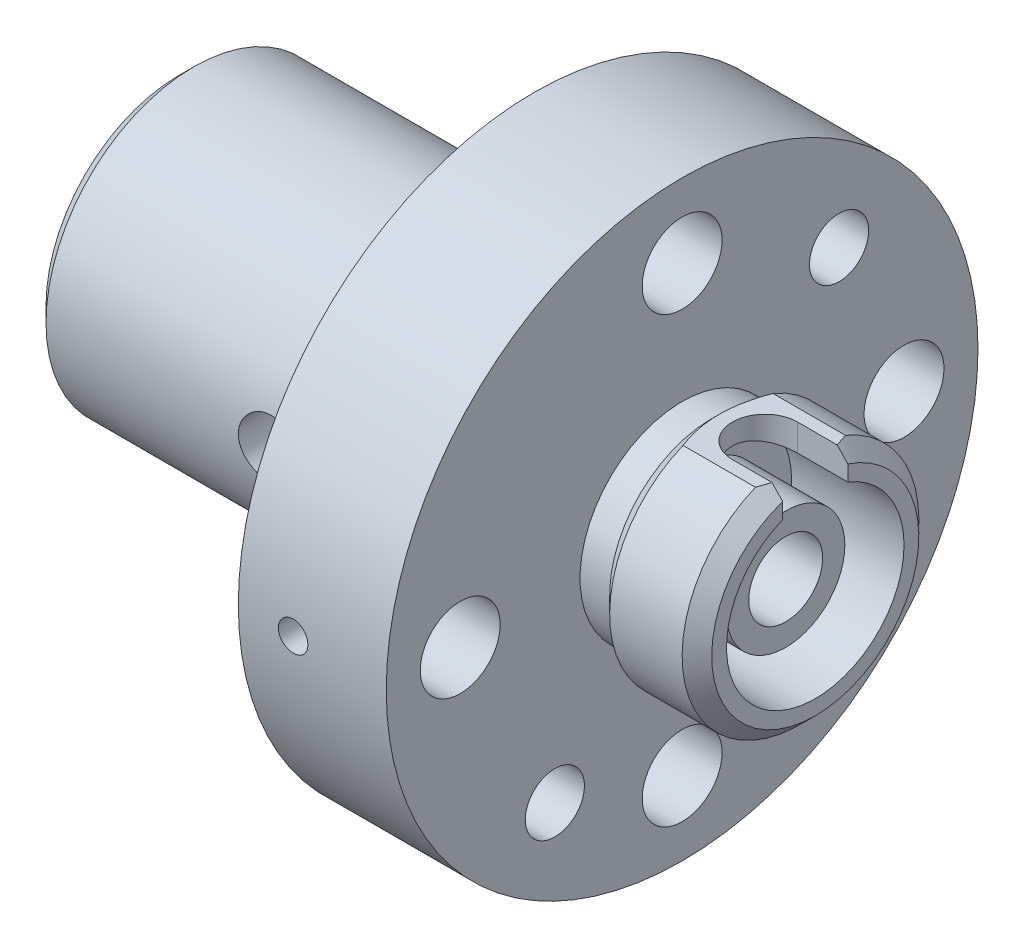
from build123d import *

# Parameters (mm, degrees)
LINEAR_AUSTRAGEN1_DEPTH          = 19.547236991
LINEAR_AUSTRAGEN1_DEPTH_BACK     = 19.547236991
SKIZZE2_W                        = 4.5
SKIZZE2_H                        = 0.8
LINEAR_AUSTRAGEN2_REACH          = 22.777
F_2_7_2_7_DURCHMESSER_BOHRUNG1_D = 2.7
KREISMUSTER1_COUNT               = 4
LINEAR_AUSTRAGEN3_REACH          = 24.113
SKIZZE6_R                        = 1
SKIZZE7_W                        = 4
SKIZZE7_H                        = 2
SKIZZE8_R                        = 1
LINEAR_AUSTRAGEN4_DEPTH          = 17.5
FASE1_SIZE                       = 0.5
SKIZZE9_R                        = 0.5
LINEAR_AUSTRAGEN5_DEPTH          = 41.5


with BuildPart() as part:
    # Skizze1 → Rotation1 (revolve)
    with BuildSketch(Plane.XY, mode=Mode.PRIVATE) as rotation1_sk:
        Polygon((-12, 1.25), (8.5, 1.25), (8.5, 2), (5.7, 2), (5.7, 3), (9.5, 3), (9.5, 3.5), (9, 4), (6.55, 4), (6, 3.45), (5, 3.45), (5, 10), (3, 10), (0, 10), (0, 5), (-12, 5), align=None)
    revolve(rotation1_sk.sketch.rotate(Axis((0, 0, 0), (-1, 0, 0)), 90), axis=Axis((0, 0, 0), (-1, 0, 0)))

    # Skizze2 → Linear austragen1 (cut, two sides: drawn at the far end of the back side and taken through both)
    with BuildSketch(Plane.XY.offset(-LINEAR_AUSTRAGEN1_DEPTH_BACK)):
        with Locations((7.25, 4.1)):
            Rectangle(SKIZZE2_W, SKIZZE2_H)
    extrude(amount=LINEAR_AUSTRAGEN1_DEPTH + LINEAR_AUSTRAGEN1_DEPTH_BACK, mode=Mode.SUBTRACT)

    # Skizze3 → Linear austragen2 (cut, up to next)
    with BuildSketch(Plane(origin=(0, 3.7, 0), x_dir=(1, 0, 0), z_dir=(0, 1, 0)), mode=Mode.PRIVATE) as linear_austragen2_sk1:
        with BuildLine():
            Line((9.5, -1.1), (9.5, 1.1))
            Line((9.5, 1.1), (7.8, 1.1))
            ThreePointArc((7.8, 1.1), (6.7, 0), (7.8, -1.1))
            Line((7.8, -1.1), (9.5, -1.1))
        make_face()
    linear_austragen2_tool1 = extrude(linear_austragen2_sk1.sketch, amount=-LINEAR_AUSTRAGEN2_REACH, mode=Mode.PRIVATE) & part.part
    add(linear_austragen2_tool1.solids().sort_by_distance((8.206276, 3.7, 0))[0], mode=Mode.SUBTRACT)

    # 2.7 _2.7_ Durchmesser Bohrung1 (through all)
    with Locations(Plane(origin=(5, -0.026407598, -0.154520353), x_dir=(0, 0, -1), z_dir=(1, 0, 0))):
        with Locations((-0.154520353, 7.526407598)):
            f_2_7_2_7_durchmesser_bohrung1 = Hole(F_2_7_2_7_DURCHMESSER_BOHRUNG1_D / 2)

    # Kreismuster1: 2.7 _2.7_ Durchmesser Bohrung1 ×4 about axis
    kreismuster1_axis = Axis((0, 0, 0), (1, 0, 0))
    for i in range(1, KREISMUSTER1_COUNT):
        add(f_2_7_2_7_durchmesser_bohrung1.rotate(kreismuster1_axis, i * 360 / KREISMUSTER1_COUNT), mode=Mode.SUBTRACT)

    # Skizze6 → Linear austragen3 (cut, up to next)
    with BuildSketch(Plane(origin=(5, 0, 0), x_dir=(0, 0, -1), z_dir=(1, 0, 0)), mode=Mode.PRIVATE) as linear_austragen3_sk1:
        with Locations((5.303300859, 5.303300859)):
            Circle(SKIZZE6_R)
    linear_austragen3_tool1 = extrude(linear_austragen3_sk1.sketch, amount=-LINEAR_AUSTRAGEN3_REACH, mode=Mode.PRIVATE) & part.part
    # Skizze6 → Linear austragen3 (cut, up to next)
    with BuildSketch(Plane(origin=(5, 0, 0), x_dir=(0, 0, -1), z_dir=(1, 0, 0)), mode=Mode.PRIVATE) as linear_austragen3_sk2:
        with Locations((-4.301823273, -6.143640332)):
            Circle(SKIZZE6_R)
    linear_austragen3_tool2 = extrude(linear_austragen3_sk2.sketch, amount=-LINEAR_AUSTRAGEN3_REACH, mode=Mode.PRIVATE) & part.part
    add(linear_austragen3_tool1.solids().sort_by_distance((5, 5.303301, -5.303301))[0], mode=Mode.SUBTRACT)
    add(linear_austragen3_tool2.solids().sort_by_distance((5, -6.14364, 4.301823))[0], mode=Mode.SUBTRACT)

    # Skizze7 → Schnitt-Rotation1 (revolve, cut)
    with BuildSketch(Plane.XY, mode=Mode.PRIVATE) as schnitt_rotation1_sk:
        with Locations((-10, 1)):
            Rectangle(SKIZZE7_W, SKIZZE7_H)
    revolve(schnitt_rotation1_sk.sketch.rotate(Axis((-12, 0, 0), (1, 0, 0)), 270), axis=Axis((-12, 0, 0), (1, 0, 0)), mode=Mode.SUBTRACT)

    # Skizze8 → Linear austragen4 (cut, symmetric)
    with BuildSketch(Plane.XY):
        with Locations((-4, 0)):
            Circle(SKIZZE8_R)
    extrude(amount=LINEAR_AUSTRAGEN4_DEPTH, both=True, mode=Mode.SUBTRACT)

    # Fase1
    fase1_edges = [part.edges().sort_by_distance(p)[0] for p in [
        (-12, 0, 5),
    ]]
    chamfer(fase1_edges, length=FASE1_SIZE)

    # Skizze9 → Linear austragen5 (cut, symmetric)
    with BuildSketch(Plane.XY):
        with Locations((1.85, 0)):
            Circle(SKIZZE9_R)
    extrude(amount=LINEAR_AUSTRAGEN5_DEPTH, both=True, mode=Mode.SUBTRACT)


solid = part.part
